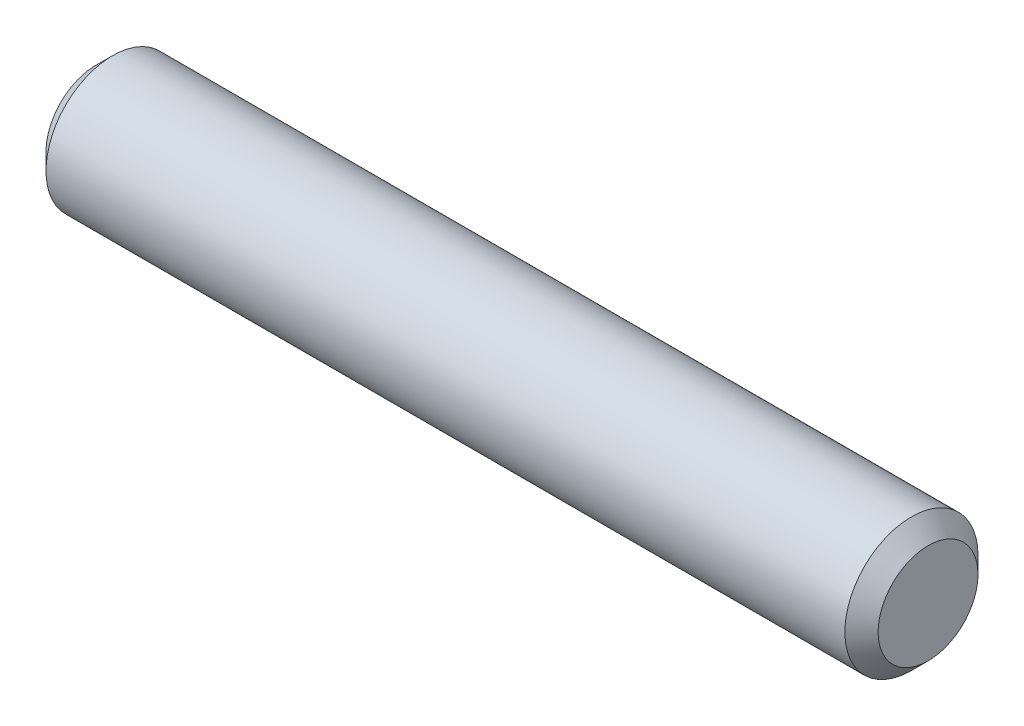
ISO-10303-21;
HEADER;
FILE_DESCRIPTION(('STEP AP214'),'2;1');
FILE_NAME('part.step','',(''),(''),'','','');
FILE_SCHEMA(('AUTOMOTIVE_DESIGN { 1 0 10303 214 1 1 1 1 }'));
ENDSEC;
DATA;
#1=APPLICATION_CONTEXT('core data for automotive mechanical design processes');
#2=APPLICATION_PROTOCOL_DEFINITION('international standard','automotive_design',2000,#1);
#3=PRODUCT_CONTEXT('',#1,'mechanical');
#4=PRODUCT('Part','Part','',(#3));
#5=PRODUCT_RELATED_PRODUCT_CATEGORY('part','',(#4));
#6=PRODUCT_DEFINITION_FORMATION('','',#4);
#7=PRODUCT_DEFINITION_CONTEXT('part definition',#1,'design');
#8=PRODUCT_DEFINITION('design','',#6,#7);
#9=PRODUCT_DEFINITION_SHAPE('','',#8);
#10=(LENGTH_UNIT() NAMED_UNIT(*) SI_UNIT(.MILLI.,.METRE.));
#11=(NAMED_UNIT(*) PLANE_ANGLE_UNIT() SI_UNIT($,.RADIAN.));
#12=(NAMED_UNIT(*) SI_UNIT($,.STERADIAN.) SOLID_ANGLE_UNIT());
#13=UNCERTAINTY_MEASURE_WITH_UNIT(LENGTH_MEASURE(1.E-05),#10,'distance_accuracy_value','');
#14=(GEOMETRIC_REPRESENTATION_CONTEXT(3) GLOBAL_UNCERTAINTY_ASSIGNED_CONTEXT((#13)) GLOBAL_UNIT_ASSIGNED_CONTEXT((#10,
#11,#12)) REPRESENTATION_CONTEXT('',''));
#15=CARTESIAN_POINT('',(0.,0.,0.));
#16=DIRECTION('',(0.,0.,1.));
#17=DIRECTION('',(1.,0.,0.));
#18=AXIS2_PLACEMENT_3D('',#15,#16,#17);
#19=CARTESIAN_POINT('',(25.,0.,0.));
#20=DIRECTION('',(-1.,0.,0.));
#21=DIRECTION('',(0.,0.,1.));
#22=AXIS2_PLACEMENT_3D('',#19,#20,#21);
#23=CYLINDRICAL_SURFACE('',#22,2.);
#24=CARTESIAN_POINT('',(0.500000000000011,0.,0.));
#25=DIRECTION('',(1.,0.,0.));
#26=DIRECTION('',(0.,0.,-1.));
#27=AXIS2_PLACEMENT_3D('',#24,#25,#26);
#28=CIRCLE('',#27,2.);
#29=CARTESIAN_POINT('',(0.500000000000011,0.,-2.));
#30=VERTEX_POINT('',#29);
#31=EDGE_CURVE('E42',#30,#30,#28,.T.);
#32=ORIENTED_EDGE('',*,*,#31,.T.);
#33=EDGE_LOOP('',(#32));
#34=FACE_BOUND('',#33,.T.);
#35=CARTESIAN_POINT('',(24.5,0.,0.));
#36=DIRECTION('',(1.,0.,0.));
#37=DIRECTION('',(0.,0.,-1.));
#38=AXIS2_PLACEMENT_3D('',#35,#36,#37);
#39=CIRCLE('',#38,2.);
#40=CARTESIAN_POINT('',(24.5,0.,-2.));
#41=VERTEX_POINT('',#40);
#42=EDGE_CURVE('E46',#41,#41,#39,.F.);
#43=ORIENTED_EDGE('',*,*,#42,.T.);
#44=EDGE_LOOP('',(#43));
#45=FACE_BOUND('',#44,.T.);
#46=ADVANCED_FACE('F32',(#34,#45),#23,.T.);
#47=CARTESIAN_POINT('',(25.,0.,0.));
#48=DIRECTION('',(1.,0.,0.));
#49=DIRECTION('',(0.,0.,-1.));
#50=AXIS2_PLACEMENT_3D('',#47,#48,#49);
#51=PLANE('',#50);
#52=CARTESIAN_POINT('',(25.,0.,0.));
#53=DIRECTION('',(1.,0.,0.));
#54=DIRECTION('',(0.,0.,-1.));
#55=AXIS2_PLACEMENT_3D('',#52,#53,#54);
#56=CIRCLE('',#55,1.49999999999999);
#57=CARTESIAN_POINT('',(25.,0.,-1.49999999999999));
#58=VERTEX_POINT('',#57);
#59=EDGE_CURVE('E10',#58,#58,#56,.T.);
#60=ORIENTED_EDGE('',*,*,#59,.T.);
#61=EDGE_LOOP('',(#60));
#62=FACE_BOUND('',#61,.T.);
#63=ADVANCED_FACE('F64',(#62),#51,.T.);
#64=CARTESIAN_POINT('',(0.,0.,0.));
#65=DIRECTION('',(1.,0.,0.));
#66=DIRECTION('',(0.,0.,-1.));
#67=AXIS2_PLACEMENT_3D('',#64,#65,#66);
#68=PLANE('',#67);
#69=CARTESIAN_POINT('',(0.,0.,0.));
#70=DIRECTION('',(1.,0.,0.));
#71=DIRECTION('',(0.,0.,-1.));
#72=AXIS2_PLACEMENT_3D('',#69,#70,#71);
#73=CIRCLE('',#72,1.5);
#74=CARTESIAN_POINT('',(0.,0.,-1.5));
#75=VERTEX_POINT('',#74);
#76=EDGE_CURVE('E38',#75,#75,#73,.F.);
#77=ORIENTED_EDGE('',*,*,#76,.T.);
#78=EDGE_LOOP('',(#77));
#79=FACE_BOUND('',#78,.T.);
#80=ADVANCED_FACE('F61',(#79),#68,.F.);
#81=CARTESIAN_POINT('',(0.500000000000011,0.,0.));
#82=DIRECTION('',(1.,0.,0.));
#83=DIRECTION('',(0.,0.,-1.));
#84=AXIS2_PLACEMENT_3D('',#81,#82,#83);
#85=CONICAL_SURFACE('',#84,2.,0.785398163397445);
#86=ORIENTED_EDGE('',*,*,#76,.F.);
#87=EDGE_LOOP('',(#86));
#88=FACE_BOUND('',#87,.T.);
#89=ORIENTED_EDGE('',*,*,#31,.F.);
#90=EDGE_LOOP('',(#89));
#91=FACE_BOUND('',#90,.T.);
#92=ADVANCED_FACE('F56',(#88,#91),#85,.T.);
#93=CARTESIAN_POINT('',(25.,0.,0.));
#94=DIRECTION('',(-1.,0.,0.));
#95=DIRECTION('',(0.,0.,1.));
#96=AXIS2_PLACEMENT_3D('',#93,#94,#95);
#97=CONICAL_SURFACE('',#96,1.49999999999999,0.785398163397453);
#98=ORIENTED_EDGE('',*,*,#42,.F.);
#99=EDGE_LOOP('',(#98));
#100=FACE_BOUND('',#99,.T.);
#101=ORIENTED_EDGE('',*,*,#59,.F.);
#102=EDGE_LOOP('',(#101));
#103=FACE_BOUND('',#102,.T.);
#104=ADVANCED_FACE('F53',(#100,#103),#97,.T.);
#105=CLOSED_SHELL('',(#46,#63,#80,#92,#104));
#106=MANIFOLD_SOLID_BREP('B2',#105);
#107=ADVANCED_BREP_SHAPE_REPRESENTATION('',(#18,#106),#14);
#108=SHAPE_DEFINITION_REPRESENTATION(#9,#107);
ENDSEC;
END-ISO-10303-21;
